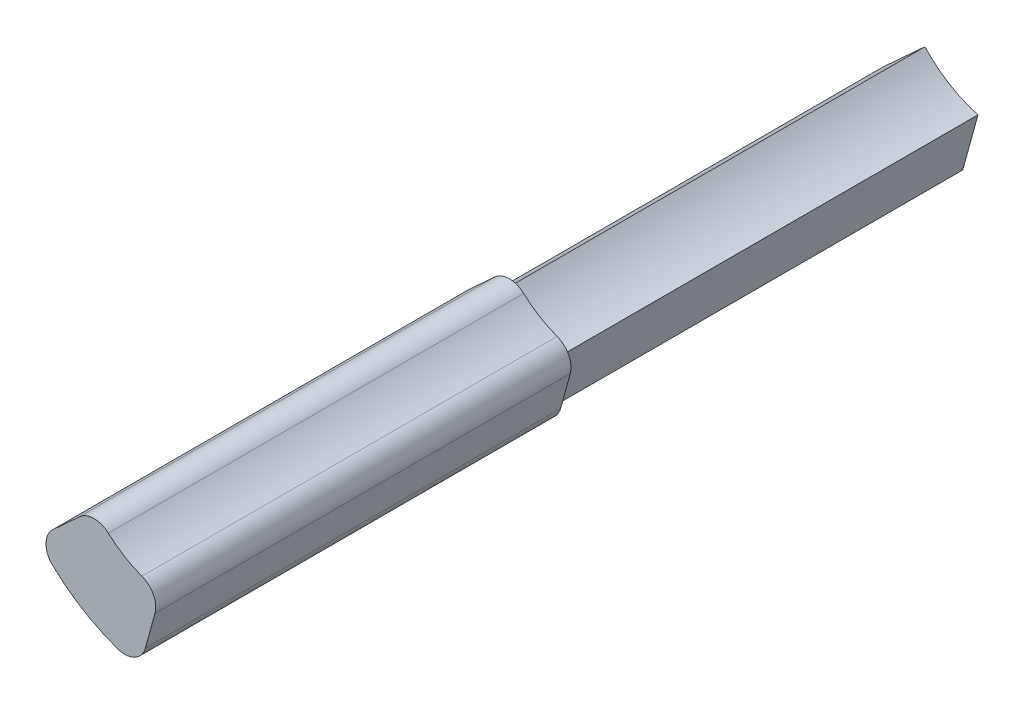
from build123d import *

# Parameters (mm, degrees)
EXTRUSION1_DEPTH = 39
EXTRUSION2_DEPTH = 19.5
CONG_1_R         = 1


with BuildPart() as part:
    # Esquisse1 → Extrusion1 (new body)
    with BuildSketch(Plane.XY):
        with BuildLine():
            Line((-3.901529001, -3.587209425), (-5.889100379, -5.414655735))
            ThreePointArc((-5.889100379, -5.414655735), (-4.168485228, -6.828157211), (-2.124909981, -7.712636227))
            Line((-2.124909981, -7.712636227), (-1.407752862, -5.109621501))
            ThreePointArc((-1.407752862, -5.109621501), (-2.761621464, -4.523654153), (-3.901529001, -3.587209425))
        make_face()
    extrude(amount=EXTRUSION1_DEPTH)

    # Esquisse2 → Extrusion2 (add)
    with BuildSketch(Plane.XY.offset(39)):
        with BuildLine():
            Line((-3.852653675, -2.863050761), (-6.584750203, -5.375040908))
            ThreePointArc((-6.584750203, -5.375040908), (-4.429015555, -7.254917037), (-1.771767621, -8.313292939))
            Line((-1.771767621, -8.313292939), (-0.785970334, -4.735213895))
            ThreePointArc((-0.785970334, -4.735213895), (-2.501091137, -4.096894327), (-3.852653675, -2.863050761))
        make_face()
    extrude(amount=-EXTRUSION2_DEPTH)

    # Cong_1
    cong_1_edges = [part.edges().sort_by_distance(p)[0] for p in [
        (-3.852653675, -2.863050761, 29.25),
        (-0.785970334, -4.735213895, 29.25),
        (-1.771767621, -8.313292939, 29.25),
        (-6.584750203, -5.375040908, 29.25),
    ]]
    fillet(cong_1_edges, radius=CONG_1_R)


solid = part.part
